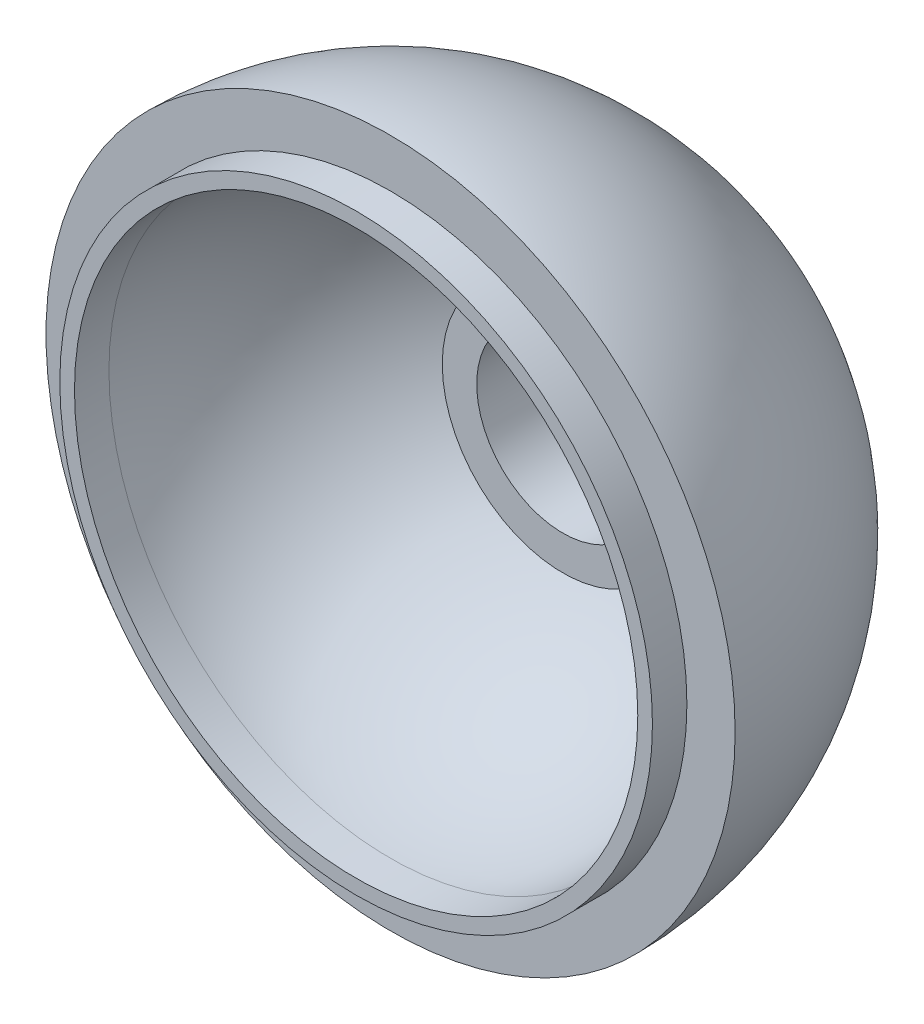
from build123d import *


with BuildPart() as part:
    # Esquisse1 → R_volution1 (revolve)
    with BuildSketch(Plane(origin=(0, 0, 0), x_dir=(1, 0, 0), z_dir=(0, 1, 0)), mode=Mode.PRIVATE) as r_volution1_sk:
        with BuildLine():
            Line((-10, 0), (-8.6, 0))
            Line((-8.6, 0), (-8.6, -1))
            Line((-8.6, -1), (-8.174456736, -1))
            Line((-8.174456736, -1), (-8.174456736, 0))
            ThreePointArc((-8.174456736, 0), (-6.907689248, 4.370992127), (-3.5, 7.387268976))
            Line((-3.5, 7.387268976), (-3.5, 5))
            Line((-3.5, 5), (-2.5, 5))
            Line((-2.5, 5), (-2.5, 7.782785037))
            ThreePointArc((-2.5, 7.782785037), (-1.265247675, 8.075945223), (0, 8.174456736))
            Line((0, 8.174456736), (0, 10))
            ThreePointArc((0, 10), (-7.071067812, 7.071067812), (-10, 0))
        make_face()
    revolve(r_volution1_sk.sketch.rotate(Axis((0, 0, 0), (0, 0, -1)), 180), axis=Axis((0, 0, 0), (0, 0, -1)))


solid = part.part
